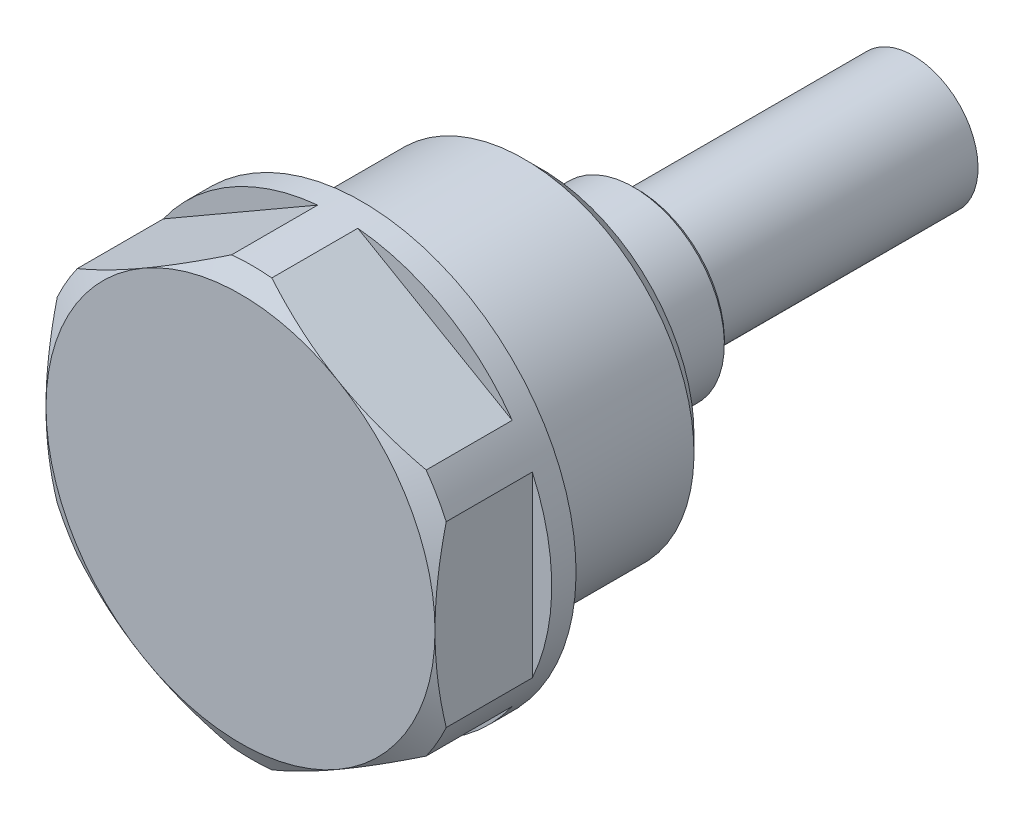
ISO-10303-21;
HEADER;
FILE_DESCRIPTION(('STEP AP214'),'2;1');
FILE_NAME('part.step','',(''),(''),'','','');
FILE_SCHEMA(('AUTOMOTIVE_DESIGN { 1 0 10303 214 1 1 1 1 }'));
ENDSEC;
DATA;
#1=APPLICATION_CONTEXT('core data for automotive mechanical design processes');
#2=APPLICATION_PROTOCOL_DEFINITION('international standard','automotive_design',2000,#1);
#3=PRODUCT_CONTEXT('',#1,'mechanical');
#4=PRODUCT('Part','Part','',(#3));
#5=PRODUCT_RELATED_PRODUCT_CATEGORY('part','',(#4));
#6=PRODUCT_DEFINITION_FORMATION('','',#4);
#7=PRODUCT_DEFINITION_CONTEXT('part definition',#1,'design');
#8=PRODUCT_DEFINITION('design','',#6,#7);
#9=PRODUCT_DEFINITION_SHAPE('','',#8);
#10=(LENGTH_UNIT() NAMED_UNIT(*) SI_UNIT(.MILLI.,.METRE.));
#11=(NAMED_UNIT(*) PLANE_ANGLE_UNIT() SI_UNIT($,.RADIAN.));
#12=(NAMED_UNIT(*) SI_UNIT($,.STERADIAN.) SOLID_ANGLE_UNIT());
#13=UNCERTAINTY_MEASURE_WITH_UNIT(LENGTH_MEASURE(1.E-05),#10,'distance_accuracy_value','');
#14=(GEOMETRIC_REPRESENTATION_CONTEXT(3) GLOBAL_UNCERTAINTY_ASSIGNED_CONTEXT((#13)) GLOBAL_UNIT_ASSIGNED_CONTEXT((#10,
#11,#12)) REPRESENTATION_CONTEXT('',''));
#15=CARTESIAN_POINT('',(0.,0.,0.));
#16=DIRECTION('',(0.,0.,1.));
#17=DIRECTION('',(1.,0.,0.));
#18=AXIS2_PLACEMENT_3D('',#15,#16,#17);
#19=CARTESIAN_POINT('',(0.,0.,8.));
#20=DIRECTION('',(0.,0.,-1.));
#21=DIRECTION('',(0.,-1.,0.));
#22=AXIS2_PLACEMENT_3D('',#19,#20,#21);
#23=CONICAL_SURFACE('',#22,12.,1.0471975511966);
#24=CARTESIAN_POINT('',(0.,0.,7.30717967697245));
#25=DIRECTION('',(0.,0.,-1.));
#26=DIRECTION('',(0.,-1.,0.));
#27=AXIS2_PLACEMENT_3D('',#24,#25,#26);
#28=CIRCLE('',#27,13.2);
#29=CARTESIAN_POINT('',(-1.23764764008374,13.1418502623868,7.30717967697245));
#30=VERTEX_POINT('',#29);
#31=CARTESIAN_POINT('',(1.23764764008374,13.1418502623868,7.30717967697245));
#32=VERTEX_POINT('',#31);
#33=EDGE_CURVE('E188',#30,#32,#28,.T.);
#34=ORIENTED_EDGE('',*,*,#33,.F.);
#35=CARTESIAN_POINT('',(-1.23692756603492,13.1422659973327,7.30697967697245));
#36=CARTESIAN_POINT('',(-1.49116088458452,12.9954843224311,7.37760429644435));
#37=CARTESIAN_POINT('',(-1.74634558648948,12.8481533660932,7.44380804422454));
#38=CARTESIAN_POINT('',(-2.25855159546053,12.5524310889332,7.56639921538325));
#39=CARTESIAN_POINT('',(-2.5155734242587,12.404039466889,7.62278372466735));
#40=CARTESIAN_POINT('',(-3.03153159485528,12.1061508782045,7.72477710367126));
#41=CARTESIAN_POINT('',(-3.29046979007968,11.9566528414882,7.77037357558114));
#42=CARTESIAN_POINT('',(-3.8096785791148,11.6568875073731,7.84979514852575));
#43=CARTESIAN_POINT('',(-4.0699490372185,11.5066202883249,7.883621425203));
#44=CARTESIAN_POINT('',(-4.58639607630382,11.2084494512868,7.93822448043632));
#45=CARTESIAN_POINT('',(-4.84255335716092,11.060556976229,7.95924317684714));
#46=CARTESIAN_POINT('',(-5.35542117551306,10.7644526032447,7.98877579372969));
#47=CARTESIAN_POINT('',(-5.61213173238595,10.6162406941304,7.9972892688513));
#48=CARTESIAN_POINT('',(-6.12543749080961,10.3198834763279,8.00160627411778));
#49=CARTESIAN_POINT('',(-6.38203263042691,10.1717382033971,7.99741951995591));
#50=CARTESIAN_POINT('',(-6.89481462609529,9.87568338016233,7.97645852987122));
#51=CARTESIAN_POINT('',(-7.15100150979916,9.72777381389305,7.95968518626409));
#52=CARTESIAN_POINT('',(-7.68804232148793,9.41771315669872,7.91165726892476));
#53=CARTESIAN_POINT('',(-7.96881058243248,9.25561152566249,7.87912629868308));
#54=CARTESIAN_POINT('',(-8.52889082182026,8.93224904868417,7.80015746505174));
#55=CARTESIAN_POINT('',(-8.80820266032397,8.7709882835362,7.75371828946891));
#56=CARTESIAN_POINT('',(-9.36807638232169,8.44774503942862,7.64744822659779));
#57=CARTESIAN_POINT('',(-9.64861772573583,8.28577441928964,7.58747440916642));
#58=CARTESIAN_POINT('',(-10.2075094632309,7.96309812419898,7.45574371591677));
#59=CARTESIAN_POINT('',(-10.485860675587,7.80239197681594,7.38399148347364));
#60=CARTESIAN_POINT('',(-10.7630724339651,7.64234369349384,7.30697967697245));
#61=B_SPLINE_CURVE_WITH_KNOTS('',3,(#35,#36,#37,#38,#39,#40,#41,#42,#43,#44,#45,#46,#47,#48,#49,
#50,#51,#52,#53,#54,#55,#56,#57,#58,#59,#60),.UNSPECIFIED.,.F.,.F.,(4,2,2,2,2,2,2,2,2,2,2,2,4),
(0.,0.905834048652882,1.81193646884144,2.7190751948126,3.62612328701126,4.51545957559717,
5.40482753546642,6.29351529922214,7.18214006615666,8.15930857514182,9.13656930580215,
10.1246779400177,11.1123979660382),.UNSPECIFIED.);
#62=CARTESIAN_POINT('',(-6.,10.3923048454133,8.));
#63=VERTEX_POINT('',#62);
#64=EDGE_CURVE('E291',#30,#63,#61,.T.);
#65=ORIENTED_EDGE('',*,*,#64,.T.);
#66=CARTESIAN_POINT('',(0.,0.,8.));
#67=DIRECTION('',(0.,0.,-1.));
#68=DIRECTION('',(0.,-1.,0.));
#69=AXIS2_PLACEMENT_3D('',#66,#67,#68);
#70=CIRCLE('',#69,12.);
#71=CARTESIAN_POINT('',(6.,10.3923048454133,8.));
#72=VERTEX_POINT('',#71);
#73=EDGE_CURVE('E170',#63,#72,#70,.T.);
#74=ORIENTED_EDGE('',*,*,#73,.T.);
#75=CARTESIAN_POINT('',(10.7630724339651,7.64234369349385,7.30697967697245));
#76=CARTESIAN_POINT('',(10.5088391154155,7.78912536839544,7.37760429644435));
#77=CARTESIAN_POINT('',(10.2536544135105,7.93645632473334,7.44380804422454));
#78=CARTESIAN_POINT('',(9.74144840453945,8.23217860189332,7.56639921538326));
#79=CARTESIAN_POINT('',(9.48442657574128,8.38057022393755,7.62278372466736));
#80=CARTESIAN_POINT('',(8.9684684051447,8.67845881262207,7.72477710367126));
#81=CARTESIAN_POINT('',(8.7095302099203,8.82795684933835,7.77037357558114));
#82=CARTESIAN_POINT('',(8.19032142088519,9.1277221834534,7.84979514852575));
#83=CARTESIAN_POINT('',(7.93005096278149,9.27798940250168,7.883621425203));
#84=CARTESIAN_POINT('',(7.41360392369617,9.57616023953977,7.93822448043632));
#85=CARTESIAN_POINT('',(7.15744664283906,9.7240527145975,7.95924317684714));
#86=CARTESIAN_POINT('',(6.64457882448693,10.0201570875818,7.98877579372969));
#87=CARTESIAN_POINT('',(6.38786826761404,10.1683689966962,7.9972892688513));
#88=CARTESIAN_POINT('',(5.87456250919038,10.4647262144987,8.00160627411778));
#89=CARTESIAN_POINT('',(5.61796736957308,10.6128714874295,7.99741951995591));
#90=CARTESIAN_POINT('',(5.1051853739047,10.9089263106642,7.97645852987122));
#91=CARTESIAN_POINT('',(4.84899849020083,11.0568358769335,7.95968518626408));
#92=CARTESIAN_POINT('',(4.31195767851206,11.3668965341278,7.91165726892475));
#93=CARTESIAN_POINT('',(4.03118941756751,11.528998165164,7.87912629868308));
#94=CARTESIAN_POINT('',(3.47110917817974,11.8523606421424,7.80015746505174));
#95=CARTESIAN_POINT('',(3.19179733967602,12.0136214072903,7.7537182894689));
#96=CARTESIAN_POINT('',(2.63192361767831,12.3368646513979,7.64744822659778));
#97=CARTESIAN_POINT('',(2.35138227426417,12.4988352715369,7.58747440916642));
#98=CARTESIAN_POINT('',(1.79249053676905,12.8215115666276,7.45574371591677));
#99=CARTESIAN_POINT('',(1.51413932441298,12.9822177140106,7.38399148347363));
#100=CARTESIAN_POINT('',(1.23692756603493,13.1422659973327,7.30697967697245));
#101=B_SPLINE_CURVE_WITH_KNOTS('',3,(#75,#76,#77,#78,#79,#80,#81,#82,#83,#84,#85,#86,#87,#88,
#89,#90,#91,#92,#93,#94,#95,#96,#97,#98,#99,#100),.UNSPECIFIED.,.F.,.F.,(4,2,2,2,2,2,2,2,2,2,2,
2,4),(0.,0.905834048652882,1.81193646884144,2.7190751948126,3.62612328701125,4.51545957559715,
5.4048275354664,6.29351529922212,7.18214006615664,8.1593085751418,9.13656930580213,
10.1246779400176,11.1123979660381),.UNSPECIFIED.);
#102=EDGE_CURVE('E193',#72,#32,#101,.T.);
#103=ORIENTED_EDGE('',*,*,#102,.T.);
#104=EDGE_LOOP('',(#34,#65,#74,#103));
#105=FACE_BOUND('',#104,.T.);
#106=ADVANCED_FACE('F14',(#105),#23,.T.);
#107=CARTESIAN_POINT('',(-6.,-10.3923048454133,8.));
#108=VERTEX_POINT('',#107);
#109=CARTESIAN_POINT('',(-12.,0.,8.));
#110=VERTEX_POINT('',#109);
#111=EDGE_CURVE('E171',#108,#110,#70,.T.);
#112=ORIENTED_EDGE('',*,*,#111,.T.);
#113=CARTESIAN_POINT('',(-12.,-18.3221035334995,2.28305293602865));
#114=CARTESIAN_POINT('',(-12.,-18.0588827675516,2.41018088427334));
#115=CARTESIAN_POINT('',(-12.,-17.7953423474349,2.53664665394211));
#116=CARTESIAN_POINT('',(-12.,-17.2675546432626,2.78810172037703));
#117=CARTESIAN_POINT('',(-12.,-17.0033073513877,2.9130910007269));
#118=CARTESIAN_POINT('',(-12.,-16.2093256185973,3.28565253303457));
#119=CARTESIAN_POINT('',(-12.,-15.67843781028,3.53077658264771));
#120=CARTESIAN_POINT('',(-12.,-14.6099108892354,4.01431688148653));
#121=CARTESIAN_POINT('',(-12.,-14.072250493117,4.25268621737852));
#122=CARTESIAN_POINT('',(-12.,-12.9924916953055,4.7191145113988));
#123=CARTESIAN_POINT('',(-12.,-12.4503935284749,4.94717401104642));
#124=CARTESIAN_POINT('',(-12.,-11.3544127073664,5.3928395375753));
#125=CARTESIAN_POINT('',(-12.,-10.8004665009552,5.61029010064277));
#126=CARTESIAN_POINT('',(-12.,-9.68601775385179,6.02802976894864));
#127=CARTESIAN_POINT('',(-12.,-9.12551448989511,6.22831696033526));
#128=CARTESIAN_POINT('',(-12.,-7.99824735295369,6.6063071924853));
#129=CARTESIAN_POINT('',(-12.,-7.43149987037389,6.78405871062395));
#130=CARTESIAN_POINT('',(-12.,-6.28989547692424,7.11117935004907));
#131=CARTESIAN_POINT('',(-12.,-5.71504120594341,7.2605574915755));
#132=CARTESIAN_POINT('',(-12.,-4.84656674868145,7.4578533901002));
#133=CARTESIAN_POINT('',(-12.,-4.55596982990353,7.5191687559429));
#134=CARTESIAN_POINT('',(-12.,-3.97285259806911,7.63190066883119));
#135=CARTESIAN_POINT('',(-12.,-3.68033232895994,7.68331744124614));
#136=CARTESIAN_POINT('',(-12.,-3.0935631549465,7.7753385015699));
#137=CARTESIAN_POINT('',(-12.,-2.79931411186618,7.81594191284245));
#138=CARTESIAN_POINT('',(-12.,-2.20944503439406,7.8855164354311));
#139=CARTESIAN_POINT('',(-12.,-1.91382504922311,7.91448796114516));
#140=CARTESIAN_POINT('',(-12.,-1.32347494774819,7.96002416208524));
#141=CARTESIAN_POINT('',(-12.,-1.02875073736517,7.97666490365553));
#142=CARTESIAN_POINT('',(-12.,-0.438863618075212,7.99745197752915));
#143=CARTESIAN_POINT('',(-12.,-0.14370071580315,8.00159849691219));
#144=CARTESIAN_POINT('',(-12.,0.446452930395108,7.9972990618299));
#145=CARTESIAN_POINT('',(-12.,0.741443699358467,7.98885659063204));
#146=CARTESIAN_POINT('',(-12.,1.33081400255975,7.95958749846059));
#147=CARTESIAN_POINT('',(-12.,1.62519350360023,7.93876022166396));
#148=CARTESIAN_POINT('',(-12.,2.34015568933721,7.87356912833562));
#149=CARTESIAN_POINT('',(-12.,2.7601761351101,7.82291822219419));
#150=CARTESIAN_POINT('',(-12.,3.59689120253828,7.69923665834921));
#151=CARTESIAN_POINT('',(-12.,4.01358531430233,7.62620263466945));
#152=CARTESIAN_POINT('',(-12.,5.25942254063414,7.37719329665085));
#153=CARTESIAN_POINT('',(-12.,6.08268836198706,7.17147839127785));
#154=CARTESIAN_POINT('',(-12.,7.31405355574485,6.81720655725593));
#155=CARTESIAN_POINT('',(-12.,7.72859752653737,6.68978358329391));
#156=CARTESIAN_POINT('',(-12.,8.55368039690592,6.42234450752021));
#157=CARTESIAN_POINT('',(-12.,8.96421893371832,6.28232727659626));
#158=CARTESIAN_POINT('',(-12.,9.77924273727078,5.99267468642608));
#159=CARTESIAN_POINT('',(-12.,10.1837491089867,5.84309821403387));
#160=CARTESIAN_POINT('',(-12.,10.7879673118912,5.61231213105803));
#161=CARTESIAN_POINT('',(-12.,10.988917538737,5.53432633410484));
#162=CARTESIAN_POINT('',(-12.,11.3900394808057,5.37638829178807));
#163=CARTESIAN_POINT('',(-12.,11.5902112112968,5.29643608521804));
#164=CARTESIAN_POINT('',(-12.,11.7900208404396,5.21558958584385));
#165=B_SPLINE_CURVE_WITH_KNOTS('',3,(#113,#114,#115,#116,#117,#118,#119,#120,#121,#122,#123,
#124,#125,#126,#127,#128,#129,#130,#131,#132,#133,#134,#135,#136,#137,#138,#139,#140,#141,#142,
#143,#144,#145,#146,#147,#148,#149,#150,#151,#152,#153,#154,#155,#156,#157,#158,#159,#160,#161,
#162,#163,#164),.UNSPECIFIED.,.F.,.F.,(4,2,2,2,2,2,2,2,2,2,2,2,2,2,2,2,2,2,2,2,2,2,2,2,2,4),(0.,
0.876936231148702,1.75388220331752,3.50806243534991,5.27237319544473,7.03659117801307,
8.82166678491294,10.6069411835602,12.3883075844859,14.1691067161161,15.0599508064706,
15.9507746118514,16.8416706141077,17.7325348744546,18.6178567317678,19.503165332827,
20.3882290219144,21.2733395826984,22.5418081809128,23.8104676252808,26.352686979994,
27.6536436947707,28.9547171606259,30.2484308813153,30.8950786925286,31.5417137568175),.UNSPECIFIED.);
#166=CARTESIAN_POINT('',(-12.,-5.49909083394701,7.30717967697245));
#167=VERTEX_POINT('',#166);
#168=EDGE_CURVE('E278',#110,#167,#165,.F.);
#169=ORIENTED_EDGE('',*,*,#168,.T.);
#170=CARTESIAN_POINT('',(-10.7623523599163,-7.64275942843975,7.30717967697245));
#171=VERTEX_POINT('',#170);
#172=EDGE_CURVE('E347',#171,#167,#28,.T.);
#173=ORIENTED_EDGE('',*,*,#172,.F.);
#174=CARTESIAN_POINT('',(-10.7630724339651,-7.64234369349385,7.30697967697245));
#175=CARTESIAN_POINT('',(-10.5088391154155,-7.78912536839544,7.37760429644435));
#176=CARTESIAN_POINT('',(-10.2536544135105,-7.93645632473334,7.44380804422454));
#177=CARTESIAN_POINT('',(-9.74144840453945,-8.23217860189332,7.56639921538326));
#178=CARTESIAN_POINT('',(-9.48442657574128,-8.38057022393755,7.62278372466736));
#179=CARTESIAN_POINT('',(-8.9684684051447,-8.67845881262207,7.72477710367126));
#180=CARTESIAN_POINT('',(-8.7095302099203,-8.82795684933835,7.77037357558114));
#181=CARTESIAN_POINT('',(-8.19032142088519,-9.1277221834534,7.84979514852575));
#182=CARTESIAN_POINT('',(-7.93005096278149,-9.27798940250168,7.883621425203));
#183=CARTESIAN_POINT('',(-7.41360392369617,-9.57616023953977,7.93822448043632));
#184=CARTESIAN_POINT('',(-7.15744664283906,-9.7240527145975,7.95924317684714));
#185=CARTESIAN_POINT('',(-6.64457882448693,-10.0201570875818,7.98877579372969));
#186=CARTESIAN_POINT('',(-6.38786826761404,-10.1683689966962,7.9972892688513));
#187=CARTESIAN_POINT('',(-5.87456250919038,-10.4647262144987,8.00160627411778));
#188=CARTESIAN_POINT('',(-5.61796736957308,-10.6128714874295,7.99741951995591));
#189=CARTESIAN_POINT('',(-5.1051853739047,-10.9089263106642,7.97645852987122));
#190=CARTESIAN_POINT('',(-4.84899849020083,-11.0568358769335,7.95968518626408));
#191=CARTESIAN_POINT('',(-4.31195767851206,-11.3668965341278,7.91165726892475));
#192=CARTESIAN_POINT('',(-4.03118941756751,-11.528998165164,7.87912629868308));
#193=CARTESIAN_POINT('',(-3.47110917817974,-11.8523606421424,7.80015746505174));
#194=CARTESIAN_POINT('',(-3.19179733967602,-12.0136214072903,7.7537182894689));
#195=CARTESIAN_POINT('',(-2.63192361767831,-12.3368646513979,7.64744822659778));
#196=CARTESIAN_POINT('',(-2.35138227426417,-12.4988352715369,7.58747440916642));
#197=CARTESIAN_POINT('',(-1.79249053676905,-12.8215115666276,7.45574371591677));
#198=CARTESIAN_POINT('',(-1.51413932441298,-12.9822177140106,7.38399148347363));
#199=CARTESIAN_POINT('',(-1.23692756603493,-13.1422659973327,7.30697967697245));
#200=B_SPLINE_CURVE_WITH_KNOTS('',3,(#174,#175,#176,#177,#178,#179,#180,#181,#182,#183,#184,
#185,#186,#187,#188,#189,#190,#191,#192,#193,#194,#195,#196,#197,#198,#199),.UNSPECIFIED.,.F.,
.F.,(4,2,2,2,2,2,2,2,2,2,2,2,4),(0.,0.905834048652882,1.81193646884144,2.7190751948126,
3.62612328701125,4.51545957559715,5.4048275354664,6.29351529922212,7.18214006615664,
8.1593085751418,9.13656930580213,10.1246779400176,11.1123979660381),.UNSPECIFIED.);
#201=EDGE_CURVE('E279',#171,#108,#200,.T.);
#202=ORIENTED_EDGE('',*,*,#201,.T.);
#203=EDGE_LOOP('',(#112,#169,#173,#202));
#204=FACE_BOUND('',#203,.T.);
#205=ADVANCED_FACE('F262',(#204),#23,.T.);
#206=CARTESIAN_POINT('',(6.,-10.3923048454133,8.));
#207=VERTEX_POINT('',#206);
#208=EDGE_CURVE('E283',#207,#108,#70,.T.);
#209=ORIENTED_EDGE('',*,*,#208,.T.);
#210=CARTESIAN_POINT('',(-1.23764764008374,-13.1418502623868,7.30717967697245));
#211=VERTEX_POINT('',#210);
#212=EDGE_CURVE('E289',#108,#211,#200,.T.);
#213=ORIENTED_EDGE('',*,*,#212,.T.);
#214=CARTESIAN_POINT('',(1.23764764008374,-13.1418502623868,7.30717967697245));
#215=VERTEX_POINT('',#214);
#216=EDGE_CURVE('E346',#215,#211,#28,.T.);
#217=ORIENTED_EDGE('',*,*,#216,.F.);
#218=CARTESIAN_POINT('',(1.23692756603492,-13.1422659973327,7.30697967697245));
#219=CARTESIAN_POINT('',(1.49116088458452,-12.9954843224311,7.37760429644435));
#220=CARTESIAN_POINT('',(1.74634558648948,-12.8481533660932,7.44380804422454));
#221=CARTESIAN_POINT('',(2.25855159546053,-12.5524310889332,7.56639921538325));
#222=CARTESIAN_POINT('',(2.5155734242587,-12.404039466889,7.62278372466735));
#223=CARTESIAN_POINT('',(3.03153159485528,-12.1061508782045,7.72477710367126));
#224=CARTESIAN_POINT('',(3.29046979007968,-11.9566528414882,7.77037357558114));
#225=CARTESIAN_POINT('',(3.8096785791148,-11.6568875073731,7.84979514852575));
#226=CARTESIAN_POINT('',(4.0699490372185,-11.5066202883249,7.883621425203));
#227=CARTESIAN_POINT('',(4.58639607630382,-11.2084494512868,7.93822448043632));
#228=CARTESIAN_POINT('',(4.84255335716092,-11.060556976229,7.95924317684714));
#229=CARTESIAN_POINT('',(5.35542117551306,-10.7644526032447,7.98877579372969));
#230=CARTESIAN_POINT('',(5.61213173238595,-10.6162406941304,7.9972892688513));
#231=CARTESIAN_POINT('',(6.12543749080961,-10.3198834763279,8.00160627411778));
#232=CARTESIAN_POINT('',(6.38203263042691,-10.1717382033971,7.99741951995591));
#233=CARTESIAN_POINT('',(6.89481462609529,-9.87568338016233,7.97645852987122));
#234=CARTESIAN_POINT('',(7.15100150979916,-9.72777381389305,7.95968518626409));
#235=CARTESIAN_POINT('',(7.68804232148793,-9.41771315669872,7.91165726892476));
#236=CARTESIAN_POINT('',(7.96881058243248,-9.25561152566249,7.87912629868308));
#237=CARTESIAN_POINT('',(8.52889082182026,-8.93224904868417,7.80015746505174));
#238=CARTESIAN_POINT('',(8.80820266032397,-8.7709882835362,7.75371828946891));
#239=CARTESIAN_POINT('',(9.36807638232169,-8.44774503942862,7.64744822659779));
#240=CARTESIAN_POINT('',(9.64861772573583,-8.28577441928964,7.58747440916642));
#241=CARTESIAN_POINT('',(10.2075094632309,-7.96309812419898,7.45574371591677));
#242=CARTESIAN_POINT('',(10.485860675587,-7.80239197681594,7.38399148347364));
#243=CARTESIAN_POINT('',(10.7630724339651,-7.64234369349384,7.30697967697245));
#244=B_SPLINE_CURVE_WITH_KNOTS('',3,(#218,#219,#220,#221,#222,#223,#224,#225,#226,#227,#228,
#229,#230,#231,#232,#233,#234,#235,#236,#237,#238,#239,#240,#241,#242,#243),.UNSPECIFIED.,.F.,
.F.,(4,2,2,2,2,2,2,2,2,2,2,2,4),(0.,0.905834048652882,1.81193646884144,2.7190751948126,
3.62612328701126,4.51545957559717,5.40482753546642,6.29351529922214,7.18214006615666,
8.15930857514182,9.13656930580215,10.1246779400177,11.1123979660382),.UNSPECIFIED.);
#245=EDGE_CURVE('E327',#215,#207,#244,.T.);
#246=ORIENTED_EDGE('',*,*,#245,.T.);
#247=EDGE_LOOP('',(#209,#213,#217,#246));
#248=FACE_BOUND('',#247,.T.);
#249=ADVANCED_FACE('F266',(#248),#23,.T.);
#250=CARTESIAN_POINT('',(12.,0.,8.));
#251=VERTEX_POINT('',#250);
#252=EDGE_CURVE('E459',#251,#207,#70,.T.);
#253=ORIENTED_EDGE('',*,*,#252,.T.);
#254=CARTESIAN_POINT('',(10.7623523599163,-7.64275942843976,7.30717967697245));
#255=VERTEX_POINT('',#254);
#256=EDGE_CURVE('E333',#207,#255,#244,.T.);
#257=ORIENTED_EDGE('',*,*,#256,.T.);
#258=CARTESIAN_POINT('',(12.,-5.49909083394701,7.30717967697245));
#259=VERTEX_POINT('',#258);
#260=EDGE_CURVE('E343',#259,#255,#28,.T.);
#261=ORIENTED_EDGE('',*,*,#260,.F.);
#262=CARTESIAN_POINT('',(12.,-18.3221035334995,2.28305293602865));
#263=CARTESIAN_POINT('',(12.,-18.0588827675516,2.41018088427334));
#264=CARTESIAN_POINT('',(12.,-17.7953423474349,2.53664665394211));
#265=CARTESIAN_POINT('',(12.,-17.2675546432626,2.78810172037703));
#266=CARTESIAN_POINT('',(12.,-17.0033073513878,2.9130910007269));
#267=CARTESIAN_POINT('',(12.,-16.2093256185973,3.28565253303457));
#268=CARTESIAN_POINT('',(12.,-15.67843781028,3.53077658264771));
#269=CARTESIAN_POINT('',(12.,-14.6099108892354,4.01431688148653));
#270=CARTESIAN_POINT('',(12.,-14.072250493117,4.25268621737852));
#271=CARTESIAN_POINT('',(12.,-12.9924916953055,4.71911451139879));
#272=CARTESIAN_POINT('',(12.,-12.4503935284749,4.94717401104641));
#273=CARTESIAN_POINT('',(12.,-11.3544127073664,5.3928395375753));
#274=CARTESIAN_POINT('',(12.,-10.8004665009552,5.61029010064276));
#275=CARTESIAN_POINT('',(12.,-9.68601775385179,6.02802976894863));
#276=CARTESIAN_POINT('',(12.,-9.12551448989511,6.22831696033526));
#277=CARTESIAN_POINT('',(12.,-7.99824735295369,6.6063071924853));
#278=CARTESIAN_POINT('',(12.,-7.4314998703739,6.78405871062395));
#279=CARTESIAN_POINT('',(12.,-6.28989547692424,7.11117935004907));
#280=CARTESIAN_POINT('',(12.,-5.71504120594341,7.2605574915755));
#281=CARTESIAN_POINT('',(12.,-4.84656674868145,7.4578533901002));
#282=CARTESIAN_POINT('',(12.,-4.55596982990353,7.5191687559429));
#283=CARTESIAN_POINT('',(12.,-3.9728525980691,7.63190066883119));
#284=CARTESIAN_POINT('',(12.,-3.68033232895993,7.68331744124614));
#285=CARTESIAN_POINT('',(12.,-3.09356315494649,7.7753385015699));
#286=CARTESIAN_POINT('',(12.,-2.79931411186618,7.81594191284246));
#287=CARTESIAN_POINT('',(12.,-2.20944503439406,7.8855164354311));
#288=CARTESIAN_POINT('',(12.,-1.91382504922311,7.91448796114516));
#289=CARTESIAN_POINT('',(12.,-1.32347494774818,7.96002416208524));
#290=CARTESIAN_POINT('',(12.,-1.02875073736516,7.97666490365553));
#291=CARTESIAN_POINT('',(12.,-0.438863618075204,7.99745197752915));
#292=CARTESIAN_POINT('',(12.,-0.143700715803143,8.00159849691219));
#293=CARTESIAN_POINT('',(12.,0.446452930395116,7.9972990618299));
#294=CARTESIAN_POINT('',(12.,0.741443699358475,7.98885659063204));
#295=CARTESIAN_POINT('',(12.,1.33081400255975,7.95958749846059));
#296=CARTESIAN_POINT('',(12.,1.62519350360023,7.93876022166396));
#297=CARTESIAN_POINT('',(12.,2.34015568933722,7.87356912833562));
#298=CARTESIAN_POINT('',(12.,2.76017613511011,7.82291822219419));
#299=CARTESIAN_POINT('',(12.,3.59689120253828,7.69923665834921));
#300=CARTESIAN_POINT('',(12.,4.01358531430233,7.62620263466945));
#301=CARTESIAN_POINT('',(12.,5.25942254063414,7.37719329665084));
#302=CARTESIAN_POINT('',(12.,6.08268836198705,7.17147839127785));
#303=CARTESIAN_POINT('',(12.,7.31405355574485,6.81720655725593));
#304=CARTESIAN_POINT('',(12.,7.72859752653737,6.68978358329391));
#305=CARTESIAN_POINT('',(12.,8.55368039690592,6.42234450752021));
#306=CARTESIAN_POINT('',(12.,8.96421893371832,6.28232727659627));
#307=CARTESIAN_POINT('',(12.,9.77924273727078,5.99267468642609));
#308=CARTESIAN_POINT('',(12.,10.1837491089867,5.84309821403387));
#309=CARTESIAN_POINT('',(12.,10.7879673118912,5.61231213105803));
#310=CARTESIAN_POINT('',(12.,10.988917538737,5.53432633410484));
#311=CARTESIAN_POINT('',(12.,11.3900394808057,5.37638829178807));
#312=CARTESIAN_POINT('',(12.,11.5902112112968,5.29643608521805));
#313=CARTESIAN_POINT('',(12.,11.7900208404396,5.21558958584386));
#314=B_SPLINE_CURVE_WITH_KNOTS('',3,(#262,#263,#264,#265,#266,#267,#268,#269,#270,#271,#272,
#273,#274,#275,#276,#277,#278,#279,#280,#281,#282,#283,#284,#285,#286,#287,#288,#289,#290,#291,
#292,#293,#294,#295,#296,#297,#298,#299,#300,#301,#302,#303,#304,#305,#306,#307,#308,#309,#310,
#311,#312,#313),.UNSPECIFIED.,.F.,.F.,(4,2,2,2,2,2,2,2,2,2,2,2,2,2,2,2,2,2,2,2,2,2,2,2,2,4),(0.,
0.876936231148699,1.75388220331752,3.50806243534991,5.27237319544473,7.03659117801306,
8.82166678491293,10.6069411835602,12.3883075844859,14.1691067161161,15.0599508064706,
15.9507746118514,16.8416706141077,17.7325348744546,18.6178567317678,19.503165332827,
20.3882290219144,21.2733395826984,22.5418081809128,23.8104676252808,26.352686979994,
27.6536436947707,28.9547171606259,30.2484308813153,30.8950786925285,31.5417137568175),.UNSPECIFIED.);
#315=EDGE_CURVE('E201',#259,#251,#314,.T.);
#316=ORIENTED_EDGE('',*,*,#315,.T.);
#317=EDGE_LOOP('',(#253,#257,#261,#316));
#318=FACE_BOUND('',#317,.T.);
#319=ADVANCED_FACE('F271',(#318),#23,.T.);
#320=EDGE_CURVE('E341',#72,#251,#70,.T.);
#321=ORIENTED_EDGE('',*,*,#320,.T.);
#322=CARTESIAN_POINT('',(12.,5.49909083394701,7.30717967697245));
#323=VERTEX_POINT('',#322);
#324=EDGE_CURVE('E204',#251,#323,#314,.T.);
#325=ORIENTED_EDGE('',*,*,#324,.T.);
#326=CARTESIAN_POINT('',(10.7623523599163,7.64275942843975,7.30717967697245));
#327=VERTEX_POINT('',#326);
#328=EDGE_CURVE('E340',#327,#323,#28,.T.);
#329=ORIENTED_EDGE('',*,*,#328,.F.);
#330=EDGE_CURVE('E137',#327,#72,#101,.T.);
#331=ORIENTED_EDGE('',*,*,#330,.T.);
#332=EDGE_LOOP('',(#321,#325,#329,#331));
#333=FACE_BOUND('',#332,.T.);
#334=ADVANCED_FACE('F259',(#333),#23,.T.);
#335=CARTESIAN_POINT('',(0.,0.,8.));
#336=DIRECTION('',(0.,0.,-1.));
#337=DIRECTION('',(0.,-1.,0.));
#338=AXIS2_PLACEMENT_3D('',#335,#336,#337);
#339=PLANE('',#338);
#340=EDGE_CURVE('E164',#110,#63,#70,.T.);
#341=ORIENTED_EDGE('',*,*,#340,.F.);
#342=ORIENTED_EDGE('',*,*,#111,.F.);
#343=ORIENTED_EDGE('',*,*,#208,.F.);
#344=ORIENTED_EDGE('',*,*,#252,.F.);
#345=ORIENTED_EDGE('',*,*,#320,.F.);
#346=ORIENTED_EDGE('',*,*,#73,.F.);
#347=EDGE_LOOP('',(#341,#342,#343,#344,#345,#346));
#348=FACE_BOUND('',#347,.T.);
#349=ADVANCED_FACE('F16',(#348),#339,.F.);
#350=ORIENTED_EDGE('',*,*,#340,.T.);
#351=CARTESIAN_POINT('',(-10.7623523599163,7.64275942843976,7.30717967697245));
#352=VERTEX_POINT('',#351);
#353=EDGE_CURVE('E286',#63,#352,#61,.T.);
#354=ORIENTED_EDGE('',*,*,#353,.T.);
#355=CARTESIAN_POINT('',(-12.,5.49909083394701,7.30717967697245));
#356=VERTEX_POINT('',#355);
#357=EDGE_CURVE('E144',#356,#352,#28,.T.);
#358=ORIENTED_EDGE('',*,*,#357,.F.);
#359=EDGE_CURVE('E287',#356,#110,#165,.F.);
#360=ORIENTED_EDGE('',*,*,#359,.T.);
#361=EDGE_LOOP('',(#350,#354,#358,#360));
#362=FACE_BOUND('',#361,.T.);
#363=ADVANCED_FACE('F218',(#362),#23,.T.);
#364=CARTESIAN_POINT('',(0.,0.,-33.5));
#365=DIRECTION('',(0.,0.,-1.));
#366=DIRECTION('',(0.,-1.,0.));
#367=AXIS2_PLACEMENT_3D('',#364,#365,#366);
#368=CYLINDRICAL_SURFACE('',#367,13.2);
#369=CARTESIAN_POINT('',(0.,0.,0.5));
#370=DIRECTION('',(0.,0.,-1.));
#371=DIRECTION('',(0.,-1.,0.));
#372=AXIS2_PLACEMENT_3D('',#369,#370,#371);
#373=CIRCLE('',#372,13.2);
#374=CARTESIAN_POINT('',(0.,-13.2,0.5));
#375=VERTEX_POINT('',#374);
#376=EDGE_CURVE('E349',#375,#375,#373,.T.);
#377=ORIENTED_EDGE('',*,*,#376,.F.);
#378=EDGE_LOOP('',(#377));
#379=FACE_BOUND('',#378,.T.);
#380=ORIENTED_EDGE('',*,*,#216,.T.);
#381=DIRECTION('',(0.,0.,-1.));
#382=VECTOR('',#381,1.);
#383=CARTESIAN_POINT('',(-1.23764764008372,-13.1418502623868,-33.5));
#384=LINE('',#383,#382);
#385=CARTESIAN_POINT('',(-1.23764764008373,-13.1418502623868,2.));
#386=VERTEX_POINT('',#385);
#387=EDGE_CURVE('E9',#211,#386,#384,.T.);
#388=ORIENTED_EDGE('',*,*,#387,.T.);
#389=CARTESIAN_POINT('',(0.,0.,2.));
#390=DIRECTION('',(0.,0.,-1.));
#391=DIRECTION('',(0.,-1.,0.));
#392=AXIS2_PLACEMENT_3D('',#389,#390,#391);
#393=CIRCLE('',#392,13.2);
#394=CARTESIAN_POINT('',(-10.7623523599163,-7.64275942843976,2.));
#395=VERTEX_POINT('',#394);
#396=EDGE_CURVE('E148',#386,#395,#393,.T.);
#397=ORIENTED_EDGE('',*,*,#396,.T.);
#398=DIRECTION('',(0.,0.,-1.));
#399=VECTOR('',#398,1.);
#400=CARTESIAN_POINT('',(-10.7623523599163,-7.64275942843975,-33.5));
#401=LINE('',#400,#399);
#402=EDGE_CURVE('E22',#395,#171,#401,.F.);
#403=ORIENTED_EDGE('',*,*,#402,.T.);
#404=ORIENTED_EDGE('',*,*,#172,.T.);
#405=DIRECTION('',(0.,0.,-1.));
#406=VECTOR('',#405,1.);
#407=CARTESIAN_POINT('',(-12.,-5.49909083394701,-33.5));
#408=LINE('',#407,#406);
#409=CARTESIAN_POINT('',(-12.,-5.49909083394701,2.));
#410=VERTEX_POINT('',#409);
#411=EDGE_CURVE('E153',#167,#410,#408,.T.);
#412=ORIENTED_EDGE('',*,*,#411,.T.);
#413=CARTESIAN_POINT('',(-12.,5.49909083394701,2.));
#414=VERTEX_POINT('',#413);
#415=EDGE_CURVE('E132',#410,#414,#393,.T.);
#416=ORIENTED_EDGE('',*,*,#415,.T.);
#417=DIRECTION('',(0.,0.,-1.));
#418=VECTOR('',#417,1.);
#419=CARTESIAN_POINT('',(-12.,5.49909083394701,-33.5));
#420=LINE('',#419,#418);
#421=EDGE_CURVE('E147',#414,#356,#420,.F.);
#422=ORIENTED_EDGE('',*,*,#421,.T.);
#423=ORIENTED_EDGE('',*,*,#357,.T.);
#424=DIRECTION('',(0.,0.,-1.));
#425=VECTOR('',#424,1.);
#426=CARTESIAN_POINT('',(-10.7623523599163,7.64275942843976,-33.5));
#427=LINE('',#426,#425);
#428=CARTESIAN_POINT('',(-10.7623523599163,7.64275942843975,2.));
#429=VERTEX_POINT('',#428);
#430=EDGE_CURVE('E135',#352,#429,#427,.T.);
#431=ORIENTED_EDGE('',*,*,#430,.T.);
#432=CARTESIAN_POINT('',(-1.23764764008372,13.1418502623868,2.));
#433=VERTEX_POINT('',#432);
#434=EDGE_CURVE('E120',#429,#433,#393,.T.);
#435=ORIENTED_EDGE('',*,*,#434,.T.);
#436=DIRECTION('',(0.,0.,-1.));
#437=VECTOR('',#436,1.);
#438=CARTESIAN_POINT('',(-1.23764764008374,13.1418502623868,-33.5));
#439=LINE('',#438,#437);
#440=EDGE_CURVE('E128',#433,#30,#439,.F.);
#441=ORIENTED_EDGE('',*,*,#440,.T.);
#442=ORIENTED_EDGE('',*,*,#33,.T.);
#443=DIRECTION('',(0.,0.,-1.));
#444=VECTOR('',#443,1.);
#445=CARTESIAN_POINT('',(1.23764764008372,13.1418502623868,-33.5));
#446=LINE('',#445,#444);
#447=CARTESIAN_POINT('',(1.23764764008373,13.1418502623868,2.));
#448=VERTEX_POINT('',#447);
#449=EDGE_CURVE('E129',#32,#448,#446,.T.);
#450=ORIENTED_EDGE('',*,*,#449,.T.);
#451=CARTESIAN_POINT('',(10.7623523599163,7.64275942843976,2.));
#452=VERTEX_POINT('',#451);
#453=EDGE_CURVE('E131',#448,#452,#393,.T.);
#454=ORIENTED_EDGE('',*,*,#453,.T.);
#455=DIRECTION('',(0.,0.,-1.));
#456=VECTOR('',#455,1.);
#457=CARTESIAN_POINT('',(10.7623523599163,7.64275942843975,-33.5));
#458=LINE('',#457,#456);
#459=EDGE_CURVE('E180',#452,#327,#458,.F.);
#460=ORIENTED_EDGE('',*,*,#459,.T.);
#461=ORIENTED_EDGE('',*,*,#328,.T.);
#462=DIRECTION('',(0.,0.,-1.));
#463=VECTOR('',#462,1.);
#464=CARTESIAN_POINT('',(12.,5.49909083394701,-33.5));
#465=LINE('',#464,#463);
#466=CARTESIAN_POINT('',(12.,5.49909083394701,2.));
#467=VERTEX_POINT('',#466);
#468=EDGE_CURVE('E176',#323,#467,#465,.T.);
#469=ORIENTED_EDGE('',*,*,#468,.T.);
#470=CARTESIAN_POINT('',(12.,-5.49909083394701,2.));
#471=VERTEX_POINT('',#470);
#472=EDGE_CURVE('E165',#467,#471,#393,.T.);
#473=ORIENTED_EDGE('',*,*,#472,.T.);
#474=DIRECTION('',(0.,0.,-1.));
#475=VECTOR('',#474,1.);
#476=CARTESIAN_POINT('',(12.,-5.49909083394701,-33.5));
#477=LINE('',#476,#475);
#478=EDGE_CURVE('E173',#471,#259,#477,.F.);
#479=ORIENTED_EDGE('',*,*,#478,.T.);
#480=ORIENTED_EDGE('',*,*,#260,.T.);
#481=DIRECTION('',(0.,0.,-1.));
#482=VECTOR('',#481,1.);
#483=CARTESIAN_POINT('',(10.7623523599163,-7.64275942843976,-33.5));
#484=LINE('',#483,#482);
#485=CARTESIAN_POINT('',(10.7623523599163,-7.64275942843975,2.));
#486=VERTEX_POINT('',#485);
#487=EDGE_CURVE('E168',#255,#486,#484,.T.);
#488=ORIENTED_EDGE('',*,*,#487,.T.);
#489=CARTESIAN_POINT('',(1.23764764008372,-13.1418502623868,2.));
#490=VERTEX_POINT('',#489);
#491=EDGE_CURVE('E159',#486,#490,#393,.T.);
#492=ORIENTED_EDGE('',*,*,#491,.T.);
#493=DIRECTION('',(0.,0.,-1.));
#494=VECTOR('',#493,1.);
#495=CARTESIAN_POINT('',(1.23764764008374,-13.1418502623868,-33.5));
#496=LINE('',#495,#494);
#497=EDGE_CURVE('E163',#490,#215,#496,.F.);
#498=ORIENTED_EDGE('',*,*,#497,.T.);
#499=EDGE_LOOP('',(#380,#388,#397,#403,#404,#412,#416,#422,#423,#431,#435,#441,#442,#450,#454,
#460,#461,#469,#473,#479,#480,#488,#492,#498));
#500=FACE_BOUND('',#499,.T.);
#501=ADVANCED_FACE('F141',(#379,#500),#368,.T.);
#502=CARTESIAN_POINT('',(-13.2,0.,0.5));
#503=DIRECTION('',(0.,0.,1.));
#504=DIRECTION('',(0.,1.,0.));
#505=AXIS2_PLACEMENT_3D('',#502,#503,#504);
#506=PLANE('',#505);
#507=CARTESIAN_POINT('',(0.,0.,0.5));
#508=DIRECTION('',(0.,0.,-1.));
#509=DIRECTION('',(0.,-1.,0.));
#510=AXIS2_PLACEMENT_3D('',#507,#508,#509);
#511=CIRCLE('',#510,11.2775);
#512=CARTESIAN_POINT('',(0.,-11.2775,0.5));
#513=VERTEX_POINT('',#512);
#514=EDGE_CURVE('E352',#513,#513,#511,.T.);
#515=ORIENTED_EDGE('',*,*,#514,.F.);
#516=EDGE_LOOP('',(#515));
#517=FACE_BOUND('',#516,.T.);
#518=ORIENTED_EDGE('',*,*,#376,.T.);
#519=EDGE_LOOP('',(#518));
#520=FACE_BOUND('',#519,.T.);
#521=ADVANCED_FACE('F248',(#517,#520),#506,.F.);
#522=CARTESIAN_POINT('',(0.,0.,-33.5));
#523=DIRECTION('',(0.,0.,-1.));
#524=DIRECTION('',(0.,-1.,0.));
#525=AXIS2_PLACEMENT_3D('',#522,#523,#524);
#526=CYLINDRICAL_SURFACE('',#525,11.2775);
#527=CARTESIAN_POINT('',(0.,0.,0.));
#528=DIRECTION('',(0.,0.,-1.));
#529=DIRECTION('',(0.,-1.,0.));
#530=AXIS2_PLACEMENT_3D('',#527,#528,#529);
#531=CIRCLE('',#530,11.2775);
#532=CARTESIAN_POINT('',(0.,-11.2775,0.));
#533=VERTEX_POINT('',#532);
#534=EDGE_CURVE('E355',#533,#533,#531,.T.);
#535=ORIENTED_EDGE('',*,*,#534,.F.);
#536=EDGE_LOOP('',(#535));
#537=FACE_BOUND('',#536,.T.);
#538=ORIENTED_EDGE('',*,*,#514,.T.);
#539=EDGE_LOOP('',(#538));
#540=FACE_BOUND('',#539,.T.);
#541=ADVANCED_FACE('F244',(#537,#540),#526,.T.);
#542=CARTESIAN_POINT('',(-11.2775,0.,0.));
#543=DIRECTION('',(0.,0.,1.));
#544=DIRECTION('',(0.,1.,0.));
#545=AXIS2_PLACEMENT_3D('',#542,#543,#544);
#546=PLANE('',#545);
#547=CARTESIAN_POINT('',(0.,0.,0.));
#548=DIRECTION('',(0.,0.,-1.));
#549=DIRECTION('',(0.,-1.,0.));
#550=AXIS2_PLACEMENT_3D('',#547,#548,#549);
#551=CIRCLE('',#550,10.4775);
#552=CARTESIAN_POINT('',(0.,-10.4775,0.));
#553=VERTEX_POINT('',#552);
#554=EDGE_CURVE('E358',#553,#553,#551,.T.);
#555=ORIENTED_EDGE('',*,*,#554,.F.);
#556=EDGE_LOOP('',(#555));
#557=FACE_BOUND('',#556,.T.);
#558=ORIENTED_EDGE('',*,*,#534,.T.);
#559=EDGE_LOOP('',(#558));
#560=FACE_BOUND('',#559,.T.);
#561=ADVANCED_FACE('F240',(#557,#560),#546,.F.);
#562=CARTESIAN_POINT('',(0.,0.,-33.5));
#563=DIRECTION('',(0.,0.,-1.));
#564=DIRECTION('',(0.,-1.,0.));
#565=AXIS2_PLACEMENT_3D('',#562,#563,#564);
#566=CYLINDRICAL_SURFACE('',#565,10.4775);
#567=CARTESIAN_POINT('',(0.,0.,0.5));
#568=DIRECTION('',(0.,0.,-1.));
#569=DIRECTION('',(0.,-1.,0.));
#570=AXIS2_PLACEMENT_3D('',#567,#568,#569);
#571=CIRCLE('',#570,10.4775);
#572=CARTESIAN_POINT('',(0.,-10.4775,0.5));
#573=VERTEX_POINT('',#572);
#574=EDGE_CURVE('E361',#573,#573,#571,.T.);
#575=ORIENTED_EDGE('',*,*,#574,.F.);
#576=EDGE_LOOP('',(#575));
#577=FACE_BOUND('',#576,.T.);
#578=ORIENTED_EDGE('',*,*,#554,.T.);
#579=EDGE_LOOP('',(#578));
#580=FACE_BOUND('',#579,.T.);
#581=ADVANCED_FACE('F236',(#577,#580),#566,.F.);
#582=CARTESIAN_POINT('',(-10.4775,0.,0.5));
#583=DIRECTION('',(0.,0.,1.));
#584=DIRECTION('',(0.,1.,0.));
#585=AXIS2_PLACEMENT_3D('',#582,#583,#584);
#586=PLANE('',#585);
#587=CARTESIAN_POINT('',(0.,0.,0.5));
#588=DIRECTION('',(0.,0.,-1.));
#589=DIRECTION('',(0.,-1.,0.));
#590=AXIS2_PLACEMENT_3D('',#587,#588,#589);
#591=CIRCLE('',#590,8.382);
#592=CARTESIAN_POINT('',(0.,-8.382,0.5));
#593=VERTEX_POINT('',#592);
#594=EDGE_CURVE('E364',#593,#593,#591,.T.);
#595=ORIENTED_EDGE('',*,*,#594,.F.);
#596=EDGE_LOOP('',(#595));
#597=FACE_BOUND('',#596,.T.);
#598=ORIENTED_EDGE('',*,*,#574,.T.);
#599=EDGE_LOOP('',(#598));
#600=FACE_BOUND('',#599,.T.);
#601=ADVANCED_FACE('F232',(#597,#600),#586,.F.);
#602=CARTESIAN_POINT('',(0.,0.,-33.5));
#603=DIRECTION('',(0.,0.,-1.));
#604=DIRECTION('',(0.,-1.,0.));
#605=AXIS2_PLACEMENT_3D('',#602,#603,#604);
#606=CYLINDRICAL_SURFACE('',#605,8.382);
#607=CARTESIAN_POINT('',(0.,0.,-0.5));
#608=DIRECTION('',(0.,0.,-1.));
#609=DIRECTION('',(0.,-1.,0.));
#610=AXIS2_PLACEMENT_3D('',#607,#608,#609);
#611=CIRCLE('',#610,8.382);
#612=CARTESIAN_POINT('',(0.,-8.382,-0.5));
#613=VERTEX_POINT('',#612);
#614=EDGE_CURVE('E366',#613,#613,#611,.T.);
#615=ORIENTED_EDGE('',*,*,#614,.F.);
#616=EDGE_LOOP('',(#615));
#617=FACE_BOUND('',#616,.T.);
#618=ORIENTED_EDGE('',*,*,#594,.T.);
#619=EDGE_LOOP('',(#618));
#620=FACE_BOUND('',#619,.T.);
#621=ADVANCED_FACE('F228',(#617,#620),#606,.T.);
#622=CARTESIAN_POINT('',(0.,0.,2.));
#623=DIRECTION('',(0.,0.,-1.));
#624=DIRECTION('',(0.,-1.,0.));
#625=AXIS2_PLACEMENT_3D('',#622,#623,#624);
#626=PLANE('',#625);
#627=DIRECTION('',(-0.866025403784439,-0.5,0.));
#628=VECTOR('',#627,1.);
#629=CARTESIAN_POINT('',(12.,-6.92820323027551,2.));
#630=LINE('',#629,#628);
#631=EDGE_CURVE('E452',#486,#490,#630,.T.);
#632=ORIENTED_EDGE('',*,*,#631,.T.);
#633=ORIENTED_EDGE('',*,*,#491,.F.);
#634=EDGE_LOOP('',(#632,#633));
#635=FACE_BOUND('',#634,.T.);
#636=ADVANCED_FACE('F231',(#635),#626,.F.);
#637=CARTESIAN_POINT('',(12.,-6.92820323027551,2.));
#638=DIRECTION('',(-0.5,0.866025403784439,0.));
#639=DIRECTION('',(0.866025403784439,0.5,0.));
#640=AXIS2_PLACEMENT_3D('',#637,#638,#639);
#641=PLANE('',#640);
#642=ORIENTED_EDGE('',*,*,#256,.F.);
#643=ORIENTED_EDGE('',*,*,#245,.F.);
#644=ORIENTED_EDGE('',*,*,#497,.F.);
#645=ORIENTED_EDGE('',*,*,#631,.F.);
#646=ORIENTED_EDGE('',*,*,#487,.F.);
#647=EDGE_LOOP('',(#642,#643,#644,#645,#646));
#648=FACE_BOUND('',#647,.T.);
#649=ADVANCED_FACE('F322',(#648),#641,.F.);
#650=DIRECTION('',(0.,-1.,0.));
#651=VECTOR('',#650,1.);
#652=CARTESIAN_POINT('',(12.,6.92820323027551,2.));
#653=LINE('',#652,#651);
#654=EDGE_CURVE('E450',#467,#471,#653,.T.);
#655=ORIENTED_EDGE('',*,*,#654,.T.);
#656=ORIENTED_EDGE('',*,*,#472,.F.);
#657=EDGE_LOOP('',(#655,#656));
#658=FACE_BOUND('',#657,.T.);
#659=ADVANCED_FACE('F325',(#658),#626,.F.);
#660=CARTESIAN_POINT('',(12.,6.92820323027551,2.));
#661=DIRECTION('',(-1.,0.,0.));
#662=DIRECTION('',(0.,1.,0.));
#663=AXIS2_PLACEMENT_3D('',#660,#661,#662);
#664=PLANE('',#663);
#665=ORIENTED_EDGE('',*,*,#324,.F.);
#666=ORIENTED_EDGE('',*,*,#315,.F.);
#667=ORIENTED_EDGE('',*,*,#478,.F.);
#668=ORIENTED_EDGE('',*,*,#654,.F.);
#669=ORIENTED_EDGE('',*,*,#468,.F.);
#670=EDGE_LOOP('',(#665,#666,#667,#668,#669));
#671=FACE_BOUND('',#670,.T.);
#672=ADVANCED_FACE('F225',(#671),#664,.F.);
#673=DIRECTION('',(0.866025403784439,-0.5,0.));
#674=VECTOR('',#673,1.);
#675=CARTESIAN_POINT('',(0.,13.856406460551,2.));
#676=LINE('',#675,#674);
#677=EDGE_CURVE('E196',#448,#452,#676,.T.);
#678=ORIENTED_EDGE('',*,*,#677,.T.);
#679=ORIENTED_EDGE('',*,*,#453,.F.);
#680=EDGE_LOOP('',(#678,#679));
#681=FACE_BOUND('',#680,.T.);
#682=ADVANCED_FACE('F224',(#681),#626,.F.);
#683=CARTESIAN_POINT('',(0.,13.856406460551,2.));
#684=DIRECTION('',(-0.5,-0.866025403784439,0.));
#685=DIRECTION('',(-0.866025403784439,0.5,0.));
#686=AXIS2_PLACEMENT_3D('',#683,#684,#685);
#687=PLANE('',#686);
#688=ORIENTED_EDGE('',*,*,#102,.F.);
#689=ORIENTED_EDGE('',*,*,#330,.F.);
#690=ORIENTED_EDGE('',*,*,#459,.F.);
#691=ORIENTED_EDGE('',*,*,#677,.F.);
#692=ORIENTED_EDGE('',*,*,#449,.F.);
#693=EDGE_LOOP('',(#688,#689,#690,#691,#692));
#694=FACE_BOUND('',#693,.T.);
#695=ADVANCED_FACE('F192',(#694),#687,.F.);
#696=DIRECTION('',(0.866025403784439,0.5,0.));
#697=VECTOR('',#696,1.);
#698=CARTESIAN_POINT('',(-12.,6.92820323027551,2.));
#699=LINE('',#698,#697);
#700=EDGE_CURVE('E123',#429,#433,#699,.T.);
#701=ORIENTED_EDGE('',*,*,#700,.T.);
#702=ORIENTED_EDGE('',*,*,#434,.F.);
#703=EDGE_LOOP('',(#701,#702));
#704=FACE_BOUND('',#703,.T.);
#705=ADVANCED_FACE('F122',(#704),#626,.F.);
#706=CARTESIAN_POINT('',(-12.,6.92820323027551,2.));
#707=DIRECTION('',(0.5,-0.866025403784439,0.));
#708=DIRECTION('',(-0.866025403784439,-0.5,0.));
#709=AXIS2_PLACEMENT_3D('',#706,#707,#708);
#710=PLANE('',#709);
#711=ORIENTED_EDGE('',*,*,#353,.F.);
#712=ORIENTED_EDGE('',*,*,#64,.F.);
#713=ORIENTED_EDGE('',*,*,#440,.F.);
#714=ORIENTED_EDGE('',*,*,#700,.F.);
#715=ORIENTED_EDGE('',*,*,#430,.F.);
#716=EDGE_LOOP('',(#711,#712,#713,#714,#715));
#717=FACE_BOUND('',#716,.T.);
#718=ADVANCED_FACE('F134',(#717),#710,.F.);
#719=DIRECTION('',(0.,1.,0.));
#720=VECTOR('',#719,1.);
#721=CARTESIAN_POINT('',(-12.,-6.92820323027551,2.));
#722=LINE('',#721,#720);
#723=EDGE_CURVE('E35',#410,#414,#722,.T.);
#724=ORIENTED_EDGE('',*,*,#723,.T.);
#725=ORIENTED_EDGE('',*,*,#415,.F.);
#726=EDGE_LOOP('',(#724,#725));
#727=FACE_BOUND('',#726,.T.);
#728=ADVANCED_FACE('F315',(#727),#626,.F.);
#729=CARTESIAN_POINT('',(-12.,-6.92820323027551,2.));
#730=DIRECTION('',(1.,0.,0.));
#731=DIRECTION('',(0.,-1.,0.));
#732=AXIS2_PLACEMENT_3D('',#729,#730,#731);
#733=PLANE('',#732);
#734=ORIENTED_EDGE('',*,*,#168,.F.);
#735=ORIENTED_EDGE('',*,*,#359,.F.);
#736=ORIENTED_EDGE('',*,*,#421,.F.);
#737=ORIENTED_EDGE('',*,*,#723,.F.);
#738=ORIENTED_EDGE('',*,*,#411,.F.);
#739=EDGE_LOOP('',(#734,#735,#736,#737,#738));
#740=FACE_BOUND('',#739,.T.);
#741=ADVANCED_FACE('F311',(#740),#733,.F.);
#742=CARTESIAN_POINT('',(0.,-13.856406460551,2.));
#743=DIRECTION('',(0.5,0.866025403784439,0.));
#744=DIRECTION('',(0.866025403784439,-0.5,0.));
#745=AXIS2_PLACEMENT_3D('',#742,#743,#744);
#746=PLANE('',#745);
#747=ORIENTED_EDGE('',*,*,#212,.F.);
#748=ORIENTED_EDGE('',*,*,#201,.F.);
#749=ORIENTED_EDGE('',*,*,#402,.F.);
#750=DIRECTION('',(-0.866025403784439,0.5,0.));
#751=VECTOR('',#750,1.);
#752=CARTESIAN_POINT('',(0.,-13.856406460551,2.));
#753=LINE('',#752,#751);
#754=EDGE_CURVE('E28',#386,#395,#753,.T.);
#755=ORIENTED_EDGE('',*,*,#754,.F.);
#756=ORIENTED_EDGE('',*,*,#387,.F.);
#757=EDGE_LOOP('',(#747,#748,#749,#755,#756));
#758=FACE_BOUND('',#757,.T.);
#759=ADVANCED_FACE('F314',(#758),#746,.F.);
#760=ORIENTED_EDGE('',*,*,#754,.T.);
#761=ORIENTED_EDGE('',*,*,#396,.F.);
#762=EDGE_LOOP('',(#760,#761));
#763=FACE_BOUND('',#762,.T.);
#764=ADVANCED_FACE('F320',(#763),#626,.F.);
#765=CARTESIAN_POINT('',(0.,0.,-0.5));
#766=DIRECTION('',(0.,0.,-1.));
#767=DIRECTION('',(0.,-1.,0.));
#768=AXIS2_PLACEMENT_3D('',#765,#766,#767);
#769=PLANE('',#768);
#770=CARTESIAN_POINT('',(0.,0.,-0.5));
#771=DIRECTION('',(0.,0.,-1.));
#772=DIRECTION('',(0.,-1.,0.));
#773=AXIS2_PLACEMENT_3D('',#770,#771,#772);
#774=CIRCLE('',#773,10.4775);
#775=CARTESIAN_POINT('',(0.,-10.4775,-0.5));
#776=VERTEX_POINT('',#775);
#777=EDGE_CURVE('E446',#776,#776,#774,.T.);
#778=ORIENTED_EDGE('',*,*,#777,.F.);
#779=EDGE_LOOP('',(#778));
#780=FACE_BOUND('',#779,.T.);
#781=ORIENTED_EDGE('',*,*,#614,.T.);
#782=EDGE_LOOP('',(#781));
#783=FACE_BOUND('',#782,.T.);
#784=ADVANCED_FACE('F370',(#780,#783),#769,.F.);
#785=CARTESIAN_POINT('',(0.,0.,-33.5));
#786=DIRECTION('',(0.,0.,-1.));
#787=DIRECTION('',(0.,-1.,0.));
#788=AXIS2_PLACEMENT_3D('',#785,#786,#787);
#789=CYLINDRICAL_SURFACE('',#788,10.4775);
#790=CARTESIAN_POINT('',(0.,0.,-9.5));
#791=DIRECTION('',(0.,0.,-1.));
#792=DIRECTION('',(0.,-1.,0.));
#793=AXIS2_PLACEMENT_3D('',#790,#791,#792);
#794=CIRCLE('',#793,10.4775);
#795=CARTESIAN_POINT('',(0.,-10.4775,-9.5));
#796=VERTEX_POINT('',#795);
#797=EDGE_CURVE('E443',#796,#796,#794,.T.);
#798=ORIENTED_EDGE('',*,*,#797,.F.);
#799=EDGE_LOOP('',(#798));
#800=FACE_BOUND('',#799,.T.);
#801=ORIENTED_EDGE('',*,*,#777,.T.);
#802=EDGE_LOOP('',(#801));
#803=FACE_BOUND('',#802,.T.);
#804=ADVANCED_FACE('F383',(#800,#803),#789,.T.);
#805=CARTESIAN_POINT('',(0.,0.,-9.5));
#806=DIRECTION('',(0.,0.,1.));
#807=DIRECTION('',(0.,1.,0.));
#808=AXIS2_PLACEMENT_3D('',#805,#806,#807);
#809=CONICAL_SURFACE('',#808,10.4775,0.785398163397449);
#810=CARTESIAN_POINT('',(0.,0.,-10.5));
#811=DIRECTION('',(0.,0.,-1.));
#812=DIRECTION('',(0.,-1.,0.));
#813=AXIS2_PLACEMENT_3D('',#810,#811,#812);
#814=CIRCLE('',#813,9.4775);
#815=CARTESIAN_POINT('',(0.,-9.4775,-10.5));
#816=VERTEX_POINT('',#815);
#817=EDGE_CURVE('E440',#816,#816,#814,.T.);
#818=ORIENTED_EDGE('',*,*,#817,.F.);
#819=EDGE_LOOP('',(#818));
#820=FACE_BOUND('',#819,.T.);
#821=ORIENTED_EDGE('',*,*,#797,.T.);
#822=EDGE_LOOP('',(#821));
#823=FACE_BOUND('',#822,.T.);
#824=ADVANCED_FACE('F390',(#820,#823),#809,.T.);
#825=CARTESIAN_POINT('',(-9.4775,0.,-10.5));
#826=DIRECTION('',(0.,0.,1.));
#827=DIRECTION('',(0.,1.,0.));
#828=AXIS2_PLACEMENT_3D('',#825,#826,#827);
#829=PLANE('',#828);
#830=CARTESIAN_POINT('',(0.,0.,-10.5));
#831=DIRECTION('',(0.,0.,-1.));
#832=DIRECTION('',(0.,-1.,0.));
#833=AXIS2_PLACEMENT_3D('',#830,#831,#832);
#834=CIRCLE('',#833,5.6);
#835=CARTESIAN_POINT('',(0.,-5.6,-10.5));
#836=VERTEX_POINT('',#835);
#837=EDGE_CURVE('E437',#836,#836,#834,.T.);
#838=ORIENTED_EDGE('',*,*,#837,.F.);
#839=EDGE_LOOP('',(#838));
#840=FACE_BOUND('',#839,.T.);
#841=ORIENTED_EDGE('',*,*,#817,.T.);
#842=EDGE_LOOP('',(#841));
#843=FACE_BOUND('',#842,.T.);
#844=ADVANCED_FACE('F397',(#840,#843),#829,.F.);
#845=CARTESIAN_POINT('',(0.,0.,-33.5));
#846=DIRECTION('',(0.,0.,-1.));
#847=DIRECTION('',(0.,-1.,0.));
#848=AXIS2_PLACEMENT_3D('',#845,#846,#847);
#849=CYLINDRICAL_SURFACE('',#848,5.6);
#850=CARTESIAN_POINT('',(0.,0.,-16.25));
#851=DIRECTION('',(0.,0.,-1.));
#852=DIRECTION('',(0.,-1.,0.));
#853=AXIS2_PLACEMENT_3D('',#850,#851,#852);
#854=CIRCLE('',#853,5.6);
#855=CARTESIAN_POINT('',(0.,-5.6,-16.25));
#856=VERTEX_POINT('',#855);
#857=EDGE_CURVE('E434',#856,#856,#854,.T.);
#858=ORIENTED_EDGE('',*,*,#857,.F.);
#859=EDGE_LOOP('',(#858));
#860=FACE_BOUND('',#859,.T.);
#861=ORIENTED_EDGE('',*,*,#837,.T.);
#862=EDGE_LOOP('',(#861));
#863=FACE_BOUND('',#862,.T.);
#864=ADVANCED_FACE('F401',(#860,#863),#849,.T.);
#865=CARTESIAN_POINT('',(0.,0.,-16.25));
#866=DIRECTION('',(0.,0.,1.));
#867=DIRECTION('',(0.,1.,0.));
#868=AXIS2_PLACEMENT_3D('',#865,#866,#867);
#869=CONICAL_SURFACE('',#868,5.6,0.785398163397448);
#870=CARTESIAN_POINT('',(0.,0.,-16.5));
#871=DIRECTION('',(0.,0.,-1.));
#872=DIRECTION('',(0.,-1.,0.));
#873=AXIS2_PLACEMENT_3D('',#870,#871,#872);
#874=CIRCLE('',#873,5.35);
#875=CARTESIAN_POINT('',(0.,-5.35,-16.5));
#876=VERTEX_POINT('',#875);
#877=EDGE_CURVE('E429',#876,#876,#874,.T.);
#878=ORIENTED_EDGE('',*,*,#877,.F.);
#879=EDGE_LOOP('',(#878));
#880=FACE_BOUND('',#879,.T.);
#881=ORIENTED_EDGE('',*,*,#857,.T.);
#882=EDGE_LOOP('',(#881));
#883=FACE_BOUND('',#882,.T.);
#884=ADVANCED_FACE('F405',(#880,#883),#869,.T.);
#885=CARTESIAN_POINT('',(-5.35,0.,-16.5));
#886=DIRECTION('',(0.,0.,1.));
#887=DIRECTION('',(0.,1.,0.));
#888=AXIS2_PLACEMENT_3D('',#885,#886,#887);
#889=PLANE('',#888);
#890=CARTESIAN_POINT('',(0.,0.,-16.5));
#891=DIRECTION('',(0.,0.,-1.));
#892=DIRECTION('',(0.,-1.,0.));
#893=AXIS2_PLACEMENT_3D('',#890,#891,#892);
#894=CIRCLE('',#893,4.);
#895=CARTESIAN_POINT('',(0.,-4.,-16.5));
#896=VERTEX_POINT('',#895);
#897=EDGE_CURVE('E426',#896,#896,#894,.T.);
#898=ORIENTED_EDGE('',*,*,#897,.F.);
#899=EDGE_LOOP('',(#898));
#900=FACE_BOUND('',#899,.T.);
#901=ORIENTED_EDGE('',*,*,#877,.T.);
#902=EDGE_LOOP('',(#901));
#903=FACE_BOUND('',#902,.T.);
#904=ADVANCED_FACE('F409',(#900,#903),#889,.F.);
#905=CARTESIAN_POINT('',(0.,0.,-33.5));
#906=DIRECTION('',(0.,0.,-1.));
#907=DIRECTION('',(0.,-1.,0.));
#908=AXIS2_PLACEMENT_3D('',#905,#906,#907);
#909=CYLINDRICAL_SURFACE('',#908,4.);
#910=CARTESIAN_POINT('',(0.,0.,-33.5));
#911=DIRECTION('',(0.,0.,-1.));
#912=DIRECTION('',(0.,-1.,0.));
#913=AXIS2_PLACEMENT_3D('',#910,#911,#912);
#914=CIRCLE('',#913,4.);
#915=CARTESIAN_POINT('',(0.,-4.,-33.5));
#916=VERTEX_POINT('',#915);
#917=EDGE_CURVE('E425',#916,#916,#914,.T.);
#918=ORIENTED_EDGE('',*,*,#917,.F.);
#919=EDGE_LOOP('',(#918));
#920=FACE_BOUND('',#919,.T.);
#921=ORIENTED_EDGE('',*,*,#897,.T.);
#922=EDGE_LOOP('',(#921));
#923=FACE_BOUND('',#922,.T.);
#924=ADVANCED_FACE('F413',(#920,#923),#909,.T.);
#925=CARTESIAN_POINT('',(-4.,0.,-33.5));
#926=DIRECTION('',(0.,0.,1.));
#927=DIRECTION('',(0.,1.,0.));
#928=AXIS2_PLACEMENT_3D('',#925,#926,#927);
#929=PLANE('',#928);
#930=ORIENTED_EDGE('',*,*,#917,.T.);
#931=EDGE_LOOP('',(#930));
#932=FACE_BOUND('',#931,.T.);
#933=ADVANCED_FACE('F417',(#932),#929,.F.);
#934=CLOSED_SHELL('',(#106,#205,#249,#319,#334,#349,#363,#501,#521,#541,#561,#581,#601,#621,
#636,#649,#659,#672,#682,#695,#705,#718,#728,#741,#759,#764,#784,#804,#824,#844,#864,#884,#904,
#924,#933));
#935=MANIFOLD_SOLID_BREP('B1',#934);
#936=ADVANCED_BREP_SHAPE_REPRESENTATION('',(#18,#935),#14);
#937=SHAPE_DEFINITION_REPRESENTATION(#9,#936);
ENDSEC;
END-ISO-10303-21;
